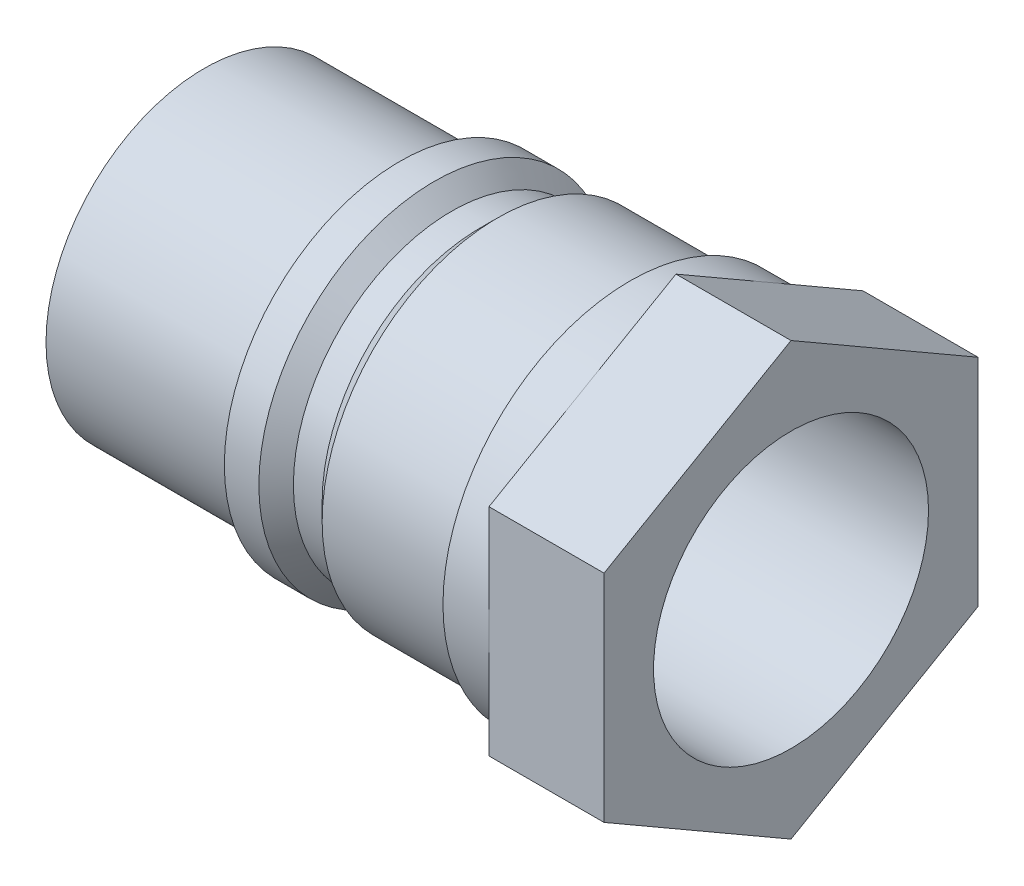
from build123d import *

# Parameters (mm, degrees)
SALIENTE_EXTRUIR1_DEPTH = 20
CROQUIS3_R              = 23.9
CORTAR_EXTRUIR1_DEPTH   = 114.439778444


with BuildPart() as part:
    # Croquis1 → Revoluci_n1 (revolve)
    with BuildSketch(Plane.XY, mode=Mode.PRIVATE) as revoluci_n1_sk:
        Polygon((0, 0), (0, 27.5), (34, 27.5), (34, 30.5), (40, 30.5), (43, 27.5), (48, 27.5), (51, 30.5), (74, 30.5), (74, 32.5), (82, 32.5), (82, 0), align=None)
    revolve(revoluci_n1_sk.sketch.rotate(Axis((0, 0, 0), (1, 0, 0)), 90), axis=Axis((0, 0, 0), (1, 0, 0)))

    # Croquis2 → Saliente-Extruir1 (add)
    with BuildSketch(Plane(origin=(82, 0, 0), x_dir=(0, 0, -1), z_dir=(1, 0, 0))):
        Polygon((0, 37.527767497), (-32.5, 18.763883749), (-32.5, -18.763883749), (0, -37.527767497), (32.5, -18.763883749), (32.5, 18.763883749), align=None)
    extrude(amount=SALIENTE_EXTRUIR1_DEPTH)

    # Croquis3 → Cortar-Extruir1 (cut, through all)
    with BuildSketch(Plane(origin=(102, 0, 0), x_dir=(0, 0, -1), z_dir=(1, 0, 0))):
        Circle(CROQUIS3_R)
    extrude(amount=-CORTAR_EXTRUIR1_DEPTH, mode=Mode.SUBTRACT)


solid = part.part
